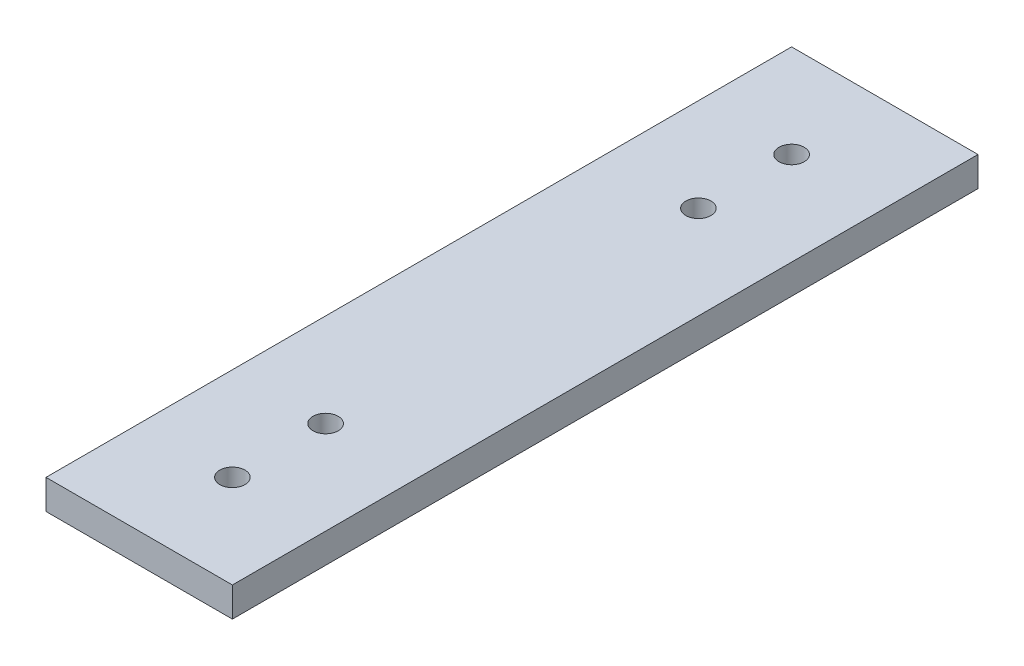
ISO-10303-21;
HEADER;
FILE_DESCRIPTION(('STEP AP214'),'2;1');
FILE_NAME('part.step','',(''),(''),'','','');
FILE_SCHEMA(('AUTOMOTIVE_DESIGN { 1 0 10303 214 1 1 1 1 }'));
ENDSEC;
DATA;
#1=APPLICATION_CONTEXT('core data for automotive mechanical design processes');
#2=APPLICATION_PROTOCOL_DEFINITION('international standard','automotive_design',2000,#1);
#3=PRODUCT_CONTEXT('',#1,'mechanical');
#4=PRODUCT('Part','Part','',(#3));
#5=PRODUCT_RELATED_PRODUCT_CATEGORY('part','',(#4));
#6=PRODUCT_DEFINITION_FORMATION('','',#4);
#7=PRODUCT_DEFINITION_CONTEXT('part definition',#1,'design');
#8=PRODUCT_DEFINITION('design','',#6,#7);
#9=PRODUCT_DEFINITION_SHAPE('','',#8);
#10=(LENGTH_UNIT() NAMED_UNIT(*) SI_UNIT(.MILLI.,.METRE.));
#11=(NAMED_UNIT(*) PLANE_ANGLE_UNIT() SI_UNIT($,.RADIAN.));
#12=(NAMED_UNIT(*) SI_UNIT($,.STERADIAN.) SOLID_ANGLE_UNIT());
#13=UNCERTAINTY_MEASURE_WITH_UNIT(LENGTH_MEASURE(1.E-05),#10,'distance_accuracy_value','');
#14=(GEOMETRIC_REPRESENTATION_CONTEXT(3) GLOBAL_UNCERTAINTY_ASSIGNED_CONTEXT((#13)) GLOBAL_UNIT_ASSIGNED_CONTEXT((#10,
#11,#12)) REPRESENTATION_CONTEXT('',''));
#15=CARTESIAN_POINT('',(0.,0.,0.));
#16=DIRECTION('',(0.,0.,1.));
#17=DIRECTION('',(1.,0.,0.));
#18=AXIS2_PLACEMENT_3D('',#15,#16,#17);
#19=CARTESIAN_POINT('',(-10.,3.175,-40.));
#20=DIRECTION('',(1.,0.,0.));
#21=DIRECTION('',(0.,0.,-1.));
#22=AXIS2_PLACEMENT_3D('',#19,#20,#21);
#23=PLANE('',#22);
#24=DIRECTION('',(0.,0.,1.));
#25=VECTOR('',#24,1.);
#26=CARTESIAN_POINT('',(-10.,0.,-40.));
#27=LINE('',#26,#25);
#28=CARTESIAN_POINT('',(-10.,0.,-40.));
#29=VERTEX_POINT('',#28);
#30=CARTESIAN_POINT('',(-10.,0.,40.));
#31=VERTEX_POINT('',#30);
#32=EDGE_CURVE('E98',#29,#31,#27,.T.);
#33=ORIENTED_EDGE('',*,*,#32,.T.);
#34=DIRECTION('',(0.,-1.,0.));
#35=VECTOR('',#34,1.);
#36=CARTESIAN_POINT('',(-10.,3.175,40.));
#37=LINE('',#36,#35);
#38=CARTESIAN_POINT('',(-10.,3.175,40.));
#39=VERTEX_POINT('',#38);
#40=EDGE_CURVE('E11',#39,#31,#37,.T.);
#41=ORIENTED_EDGE('',*,*,#40,.F.);
#42=DIRECTION('',(0.,0.,1.));
#43=VECTOR('',#42,1.);
#44=CARTESIAN_POINT('',(-10.,3.175,-40.));
#45=LINE('',#44,#43);
#46=CARTESIAN_POINT('',(-10.,3.175,-40.));
#47=VERTEX_POINT('',#46);
#48=EDGE_CURVE('E86',#47,#39,#45,.T.);
#49=ORIENTED_EDGE('',*,*,#48,.F.);
#50=DIRECTION('',(0.,-1.,0.));
#51=VECTOR('',#50,1.);
#52=CARTESIAN_POINT('',(-10.,3.175,-40.));
#53=LINE('',#52,#51);
#54=EDGE_CURVE('E94',#47,#29,#53,.T.);
#55=ORIENTED_EDGE('',*,*,#54,.T.);
#56=EDGE_LOOP('',(#33,#41,#49,#55));
#57=FACE_BOUND('',#56,.T.);
#58=ADVANCED_FACE('F35',(#57),#23,.F.);
#59=CARTESIAN_POINT('',(-10.,3.175,40.));
#60=DIRECTION('',(0.,0.,-1.));
#61=DIRECTION('',(-1.,0.,0.));
#62=AXIS2_PLACEMENT_3D('',#59,#60,#61);
#63=PLANE('',#62);
#64=DIRECTION('',(1.,0.,0.));
#65=VECTOR('',#64,1.);
#66=CARTESIAN_POINT('',(-10.,0.,40.));
#67=LINE('',#66,#65);
#68=CARTESIAN_POINT('',(10.,0.,40.));
#69=VERTEX_POINT('',#68);
#70=EDGE_CURVE('E90',#31,#69,#67,.T.);
#71=ORIENTED_EDGE('',*,*,#70,.T.);
#72=DIRECTION('',(0.,-1.,0.));
#73=VECTOR('',#72,1.);
#74=CARTESIAN_POINT('',(10.,3.175,40.));
#75=LINE('',#74,#73);
#76=CARTESIAN_POINT('',(10.,3.175,40.));
#77=VERTEX_POINT('',#76);
#78=EDGE_CURVE('E43',#77,#69,#75,.T.);
#79=ORIENTED_EDGE('',*,*,#78,.F.);
#80=DIRECTION('',(1.,0.,0.));
#81=VECTOR('',#80,1.);
#82=CARTESIAN_POINT('',(-10.,3.175,40.));
#83=LINE('',#82,#81);
#84=EDGE_CURVE('E81',#39,#77,#83,.T.);
#85=ORIENTED_EDGE('',*,*,#84,.F.);
#86=ORIENTED_EDGE('',*,*,#40,.T.);
#87=EDGE_LOOP('',(#71,#79,#85,#86));
#88=FACE_BOUND('',#87,.T.);
#89=ADVANCED_FACE('F89',(#88),#63,.F.);
#90=CARTESIAN_POINT('',(9.99999999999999,3.175,-40.));
#91=DIRECTION('',(-1.,0.,0.));
#92=DIRECTION('',(0.,0.,1.));
#93=AXIS2_PLACEMENT_3D('',#90,#91,#92);
#94=PLANE('',#93);
#95=DIRECTION('',(0.,0.,-1.));
#96=VECTOR('',#95,1.);
#97=CARTESIAN_POINT('',(9.99999999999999,0.,-40.));
#98=LINE('',#97,#96);
#99=CARTESIAN_POINT('',(9.99999999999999,0.,-40.));
#100=VERTEX_POINT('',#99);
#101=EDGE_CURVE('E68',#69,#100,#98,.T.);
#102=ORIENTED_EDGE('',*,*,#101,.T.);
#103=DIRECTION('',(0.,-1.,0.));
#104=VECTOR('',#103,1.);
#105=CARTESIAN_POINT('',(9.99999999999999,3.175,-40.));
#106=LINE('',#105,#104);
#107=CARTESIAN_POINT('',(9.99999999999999,3.175,-40.));
#108=VERTEX_POINT('',#107);
#109=EDGE_CURVE('E91',#108,#100,#106,.T.);
#110=ORIENTED_EDGE('',*,*,#109,.F.);
#111=DIRECTION('',(0.,0.,-1.));
#112=VECTOR('',#111,1.);
#113=CARTESIAN_POINT('',(9.99999999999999,3.175,-40.));
#114=LINE('',#113,#112);
#115=EDGE_CURVE('E84',#77,#108,#114,.T.);
#116=ORIENTED_EDGE('',*,*,#115,.F.);
#117=ORIENTED_EDGE('',*,*,#78,.T.);
#118=EDGE_LOOP('',(#102,#110,#116,#117));
#119=FACE_BOUND('',#118,.T.);
#120=ADVANCED_FACE('F92',(#119),#94,.F.);
#121=CARTESIAN_POINT('',(-10.,3.175,-40.));
#122=DIRECTION('',(0.,0.,1.));
#123=DIRECTION('',(1.,0.,0.));
#124=AXIS2_PLACEMENT_3D('',#121,#122,#123);
#125=PLANE('',#124);
#126=DIRECTION('',(-1.,0.,0.));
#127=VECTOR('',#126,1.);
#128=CARTESIAN_POINT('',(-10.,0.,-40.));
#129=LINE('',#128,#127);
#130=EDGE_CURVE('E74',#100,#29,#129,.T.);
#131=ORIENTED_EDGE('',*,*,#130,.T.);
#132=ORIENTED_EDGE('',*,*,#54,.F.);
#133=DIRECTION('',(-1.,0.,0.));
#134=VECTOR('',#133,1.);
#135=CARTESIAN_POINT('',(-10.,3.175,-40.));
#136=LINE('',#135,#134);
#137=EDGE_CURVE('E51',#108,#47,#136,.T.);
#138=ORIENTED_EDGE('',*,*,#137,.F.);
#139=ORIENTED_EDGE('',*,*,#109,.T.);
#140=EDGE_LOOP('',(#131,#132,#138,#139));
#141=FACE_BOUND('',#140,.T.);
#142=ADVANCED_FACE('F106',(#141),#125,.F.);
#143=CARTESIAN_POINT('',(0.,3.175,0.));
#144=DIRECTION('',(0.,1.,0.));
#145=DIRECTION('',(0.,0.,1.));
#146=AXIS2_PLACEMENT_3D('',#143,#144,#145);
#147=PLANE('',#146);
#148=CARTESIAN_POINT('',(0.,3.175,30.));
#149=DIRECTION('',(0.,1.,0.));
#150=DIRECTION('',(0.,0.,1.));
#151=AXIS2_PLACEMENT_3D('',#148,#149,#150);
#152=CIRCLE('',#151,1.35254999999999);
#153=CARTESIAN_POINT('',(0.,3.175,31.35255));
#154=VERTEX_POINT('',#153);
#155=EDGE_CURVE('E132',#154,#154,#152,.T.);
#156=ORIENTED_EDGE('',*,*,#155,.F.);
#157=EDGE_LOOP('',(#156));
#158=FACE_BOUND('',#157,.T.);
#159=CARTESIAN_POINT('',(0.,3.175,20.));
#160=DIRECTION('',(0.,1.,0.));
#161=DIRECTION('',(0.,0.,1.));
#162=AXIS2_PLACEMENT_3D('',#159,#160,#161);
#163=CIRCLE('',#162,1.35254999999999);
#164=CARTESIAN_POINT('',(0.,3.175,21.35255));
#165=VERTEX_POINT('',#164);
#166=EDGE_CURVE('E126',#165,#165,#163,.T.);
#167=ORIENTED_EDGE('',*,*,#166,.F.);
#168=EDGE_LOOP('',(#167));
#169=FACE_BOUND('',#168,.T.);
#170=CARTESIAN_POINT('',(0.,3.175,-30.));
#171=DIRECTION('',(0.,1.,0.));
#172=DIRECTION('',(0.,0.,1.));
#173=AXIS2_PLACEMENT_3D('',#170,#171,#172);
#174=CIRCLE('',#173,1.35254999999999);
#175=CARTESIAN_POINT('',(0.,3.175,-28.64745));
#176=VERTEX_POINT('',#175);
#177=EDGE_CURVE('E120',#176,#176,#174,.T.);
#178=ORIENTED_EDGE('',*,*,#177,.F.);
#179=EDGE_LOOP('',(#178));
#180=FACE_BOUND('',#179,.T.);
#181=CARTESIAN_POINT('',(0.,3.175,-20.));
#182=DIRECTION('',(0.,1.,0.));
#183=DIRECTION('',(0.,0.,1.));
#184=AXIS2_PLACEMENT_3D('',#181,#182,#183);
#185=CIRCLE('',#184,1.35254999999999);
#186=CARTESIAN_POINT('',(0.,3.175,-18.64745));
#187=VERTEX_POINT('',#186);
#188=EDGE_CURVE('E114',#187,#187,#185,.T.);
#189=ORIENTED_EDGE('',*,*,#188,.F.);
#190=EDGE_LOOP('',(#189));
#191=FACE_BOUND('',#190,.T.);
#192=ORIENTED_EDGE('',*,*,#48,.T.);
#193=ORIENTED_EDGE('',*,*,#84,.T.);
#194=ORIENTED_EDGE('',*,*,#115,.T.);
#195=ORIENTED_EDGE('',*,*,#137,.T.);
#196=EDGE_LOOP('',(#192,#193,#194,#195));
#197=FACE_BOUND('',#196,.T.);
#198=ADVANCED_FACE('F82',(#158,#169,#180,#191,#197),#147,.T.);
#199=CARTESIAN_POINT('',(0.,0.,0.));
#200=DIRECTION('',(0.,1.,0.));
#201=DIRECTION('',(0.,0.,1.));
#202=AXIS2_PLACEMENT_3D('',#199,#200,#201);
#203=PLANE('',#202);
#204=CARTESIAN_POINT('',(0.,0.,30.));
#205=DIRECTION('',(0.,1.,0.));
#206=DIRECTION('',(0.,0.,1.));
#207=AXIS2_PLACEMENT_3D('',#204,#205,#206);
#208=CIRCLE('',#207,1.35255);
#209=CARTESIAN_POINT('',(0.,0.,31.35255));
#210=VERTEX_POINT('',#209);
#211=EDGE_CURVE('E129',#210,#210,#208,.T.);
#212=ORIENTED_EDGE('',*,*,#211,.T.);
#213=EDGE_LOOP('',(#212));
#214=FACE_BOUND('',#213,.T.);
#215=CARTESIAN_POINT('',(0.,0.,20.));
#216=DIRECTION('',(0.,1.,0.));
#217=DIRECTION('',(0.,0.,1.));
#218=AXIS2_PLACEMENT_3D('',#215,#216,#217);
#219=CIRCLE('',#218,1.35255);
#220=CARTESIAN_POINT('',(0.,0.,21.35255));
#221=VERTEX_POINT('',#220);
#222=EDGE_CURVE('E123',#221,#221,#219,.T.);
#223=ORIENTED_EDGE('',*,*,#222,.T.);
#224=EDGE_LOOP('',(#223));
#225=FACE_BOUND('',#224,.T.);
#226=CARTESIAN_POINT('',(0.,0.,-30.));
#227=DIRECTION('',(0.,1.,0.));
#228=DIRECTION('',(0.,0.,1.));
#229=AXIS2_PLACEMENT_3D('',#226,#227,#228);
#230=CIRCLE('',#229,1.35255);
#231=CARTESIAN_POINT('',(0.,0.,-28.64745));
#232=VERTEX_POINT('',#231);
#233=EDGE_CURVE('E117',#232,#232,#230,.T.);
#234=ORIENTED_EDGE('',*,*,#233,.T.);
#235=EDGE_LOOP('',(#234));
#236=FACE_BOUND('',#235,.T.);
#237=CARTESIAN_POINT('',(0.,0.,-20.));
#238=DIRECTION('',(0.,1.,0.));
#239=DIRECTION('',(0.,0.,1.));
#240=AXIS2_PLACEMENT_3D('',#237,#238,#239);
#241=CIRCLE('',#240,1.35255);
#242=CARTESIAN_POINT('',(0.,0.,-18.64745));
#243=VERTEX_POINT('',#242);
#244=EDGE_CURVE('E101',#243,#243,#241,.T.);
#245=ORIENTED_EDGE('',*,*,#244,.T.);
#246=EDGE_LOOP('',(#245));
#247=FACE_BOUND('',#246,.T.);
#248=ORIENTED_EDGE('',*,*,#32,.F.);
#249=ORIENTED_EDGE('',*,*,#130,.F.);
#250=ORIENTED_EDGE('',*,*,#101,.F.);
#251=ORIENTED_EDGE('',*,*,#70,.F.);
#252=EDGE_LOOP('',(#248,#249,#250,#251));
#253=FACE_BOUND('',#252,.T.);
#254=ADVANCED_FACE('F109',(#214,#225,#236,#247,#253),#203,.F.);
#255=CARTESIAN_POINT('',(0.,3.175,-20.));
#256=DIRECTION('',(0.,1.,0.));
#257=DIRECTION('',(0.,0.,1.));
#258=AXIS2_PLACEMENT_3D('',#255,#256,#257);
#259=CYLINDRICAL_SURFACE('',#258,1.35254999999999);
#260=ORIENTED_EDGE('',*,*,#244,.F.);
#261=EDGE_LOOP('',(#260));
#262=FACE_BOUND('',#261,.T.);
#263=ORIENTED_EDGE('',*,*,#188,.T.);
#264=EDGE_LOOP('',(#263));
#265=FACE_BOUND('',#264,.T.);
#266=ADVANCED_FACE('F147',(#262,#265),#259,.F.);
#267=CARTESIAN_POINT('',(0.,3.175,-30.));
#268=DIRECTION('',(0.,1.,0.));
#269=DIRECTION('',(0.,0.,1.));
#270=AXIS2_PLACEMENT_3D('',#267,#268,#269);
#271=CYLINDRICAL_SURFACE('',#270,1.35254999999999);
#272=ORIENTED_EDGE('',*,*,#233,.F.);
#273=EDGE_LOOP('',(#272));
#274=FACE_BOUND('',#273,.T.);
#275=ORIENTED_EDGE('',*,*,#177,.T.);
#276=EDGE_LOOP('',(#275));
#277=FACE_BOUND('',#276,.T.);
#278=ADVANCED_FACE('F149',(#274,#277),#271,.F.);
#279=CARTESIAN_POINT('',(0.,3.175,20.));
#280=DIRECTION('',(0.,1.,0.));
#281=DIRECTION('',(0.,0.,1.));
#282=AXIS2_PLACEMENT_3D('',#279,#280,#281);
#283=CYLINDRICAL_SURFACE('',#282,1.35254999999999);
#284=ORIENTED_EDGE('',*,*,#222,.F.);
#285=EDGE_LOOP('',(#284));
#286=FACE_BOUND('',#285,.T.);
#287=ORIENTED_EDGE('',*,*,#166,.T.);
#288=EDGE_LOOP('',(#287));
#289=FACE_BOUND('',#288,.T.);
#290=ADVANCED_FACE('F156',(#286,#289),#283,.F.);
#291=CARTESIAN_POINT('',(0.,3.175,30.));
#292=DIRECTION('',(0.,1.,0.));
#293=DIRECTION('',(0.,0.,1.));
#294=AXIS2_PLACEMENT_3D('',#291,#292,#293);
#295=CYLINDRICAL_SURFACE('',#294,1.35254999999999);
#296=ORIENTED_EDGE('',*,*,#211,.F.);
#297=EDGE_LOOP('',(#296));
#298=FACE_BOUND('',#297,.T.);
#299=ORIENTED_EDGE('',*,*,#155,.T.);
#300=EDGE_LOOP('',(#299));
#301=FACE_BOUND('',#300,.T.);
#302=ADVANCED_FACE('F136',(#298,#301),#295,.F.);
#303=CLOSED_SHELL('',(#58,#89,#120,#142,#198,#254,#266,#278,#290,#302));
#304=MANIFOLD_SOLID_BREP('B2',#303);
#305=ADVANCED_BREP_SHAPE_REPRESENTATION('',(#18,#304),#14);
#306=SHAPE_DEFINITION_REPRESENTATION(#9,#305);
ENDSEC;
END-ISO-10303-21;
